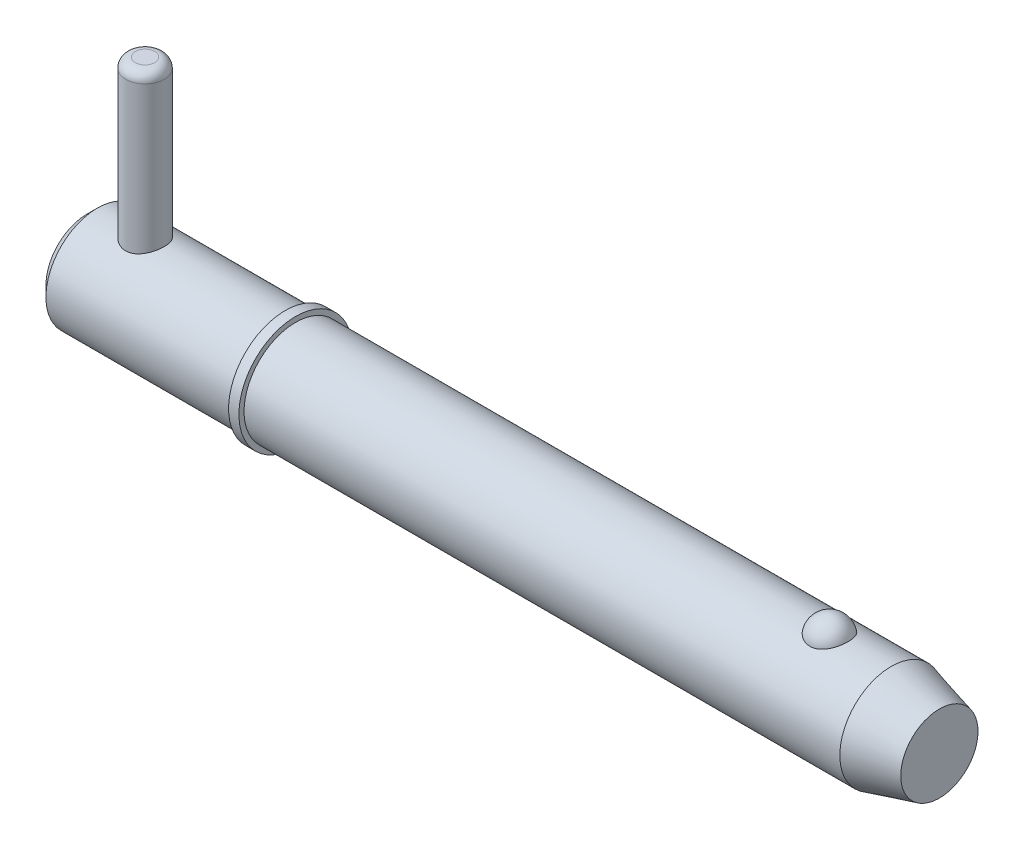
ISO-10303-21;
HEADER;
FILE_DESCRIPTION(('STEP AP214'),'2;1');
FILE_NAME('part.step','',(''),(''),'','','');
FILE_SCHEMA(('AUTOMOTIVE_DESIGN { 1 0 10303 214 1 1 1 1 }'));
ENDSEC;
DATA;
#1=APPLICATION_CONTEXT('core data for automotive mechanical design processes');
#2=APPLICATION_PROTOCOL_DEFINITION('international standard','automotive_design',2000,#1);
#3=PRODUCT_CONTEXT('',#1,'mechanical');
#4=PRODUCT('Part','Part','',(#3));
#5=PRODUCT_RELATED_PRODUCT_CATEGORY('part','',(#4));
#6=PRODUCT_DEFINITION_FORMATION('','',#4);
#7=PRODUCT_DEFINITION_CONTEXT('part definition',#1,'design');
#8=PRODUCT_DEFINITION('design','',#6,#7);
#9=PRODUCT_DEFINITION_SHAPE('','',#8);
#10=(LENGTH_UNIT() NAMED_UNIT(*) SI_UNIT(.MILLI.,.METRE.));
#11=(NAMED_UNIT(*) PLANE_ANGLE_UNIT() SI_UNIT($,.RADIAN.));
#12=(NAMED_UNIT(*) SI_UNIT($,.STERADIAN.) SOLID_ANGLE_UNIT());
#13=UNCERTAINTY_MEASURE_WITH_UNIT(LENGTH_MEASURE(1.E-05),#10,'distance_accuracy_value','');
#14=(GEOMETRIC_REPRESENTATION_CONTEXT(3) GLOBAL_UNCERTAINTY_ASSIGNED_CONTEXT((#13)) GLOBAL_UNIT_ASSIGNED_CONTEXT((#10,
#11,#12)) REPRESENTATION_CONTEXT('',''));
#15=CARTESIAN_POINT('',(0.,0.,0.));
#16=DIRECTION('',(0.,0.,1.));
#17=DIRECTION('',(1.,0.,0.));
#18=AXIS2_PLACEMENT_3D('',#15,#16,#17);
#19=CARTESIAN_POINT('',(7.14,25.4,0.));
#20=DIRECTION('',(0.,-1.,0.));
#21=DIRECTION('',(0.,0.,-1.));
#22=AXIS2_PLACEMENT_3D('',#19,#20,#21);
#23=CYLINDRICAL_SURFACE('',#22,2.38);
#24=CARTESIAN_POINT('',(7.14,-5.16,0.));
#25=DIRECTION('',(0.,1.,0.));
#26=DIRECTION('',(0.,0.,1.));
#27=AXIS2_PLACEMENT_3D('',#24,#25,#26);
#28=CIRCLE('',#27,2.38);
#29=CARTESIAN_POINT('',(7.14,-5.16,2.38));
#30=VERTEX_POINT('',#29);
#31=EDGE_CURVE('P0_E25',#30,#30,#28,.T.);
#32=ORIENTED_EDGE('',*,*,#31,.T.);
#33=EDGE_LOOP('',(#32));
#34=FACE_BOUND('',#33,.T.);
#35=CARTESIAN_POINT('',(7.14,24.21,0.));
#36=DIRECTION('',(0.,1.,0.));
#37=DIRECTION('',(0.,0.,1.));
#38=AXIS2_PLACEMENT_3D('',#35,#36,#37);
#39=CIRCLE('',#38,2.38);
#40=CARTESIAN_POINT('',(7.14,24.21,2.38));
#41=VERTEX_POINT('',#40);
#42=EDGE_CURVE('P0_E29',#41,#41,#39,.F.);
#43=ORIENTED_EDGE('',*,*,#42,.T.);
#44=EDGE_LOOP('',(#43));
#45=FACE_BOUND('',#44,.T.);
#46=ADVANCED_FACE('P0_F14',(#34,#45),#23,.T.);
#47=CARTESIAN_POINT('',(7.14,25.4,0.));
#48=DIRECTION('',(0.,1.,0.));
#49=DIRECTION('',(0.,0.,1.));
#50=AXIS2_PLACEMENT_3D('',#47,#48,#49);
#51=PLANE('',#50);
#52=CARTESIAN_POINT('',(7.14,25.4,0.));
#53=DIRECTION('',(0.,1.,0.));
#54=DIRECTION('',(0.,0.,1.));
#55=AXIS2_PLACEMENT_3D('',#52,#53,#54);
#56=CIRCLE('',#55,1.19);
#57=CARTESIAN_POINT('',(7.14,25.4,1.19));
#58=VERTEX_POINT('',#57);
#59=EDGE_CURVE('P0_E10',#58,#58,#56,.T.);
#60=ORIENTED_EDGE('',*,*,#59,.T.);
#61=EDGE_LOOP('',(#60));
#62=FACE_BOUND('',#61,.T.);
#63=ADVANCED_FACE('P0_F46',(#62),#51,.T.);
#64=CARTESIAN_POINT('',(7.14,-6.35,0.));
#65=DIRECTION('',(0.,1.,0.));
#66=DIRECTION('',(0.,0.,1.));
#67=AXIS2_PLACEMENT_3D('',#64,#65,#66);
#68=PLANE('',#67);
#69=CARTESIAN_POINT('',(7.14,-6.35,0.));
#70=DIRECTION('',(0.,1.,0.));
#71=DIRECTION('',(0.,0.,1.));
#72=AXIS2_PLACEMENT_3D('',#69,#70,#71);
#73=CIRCLE('',#72,1.19);
#74=CARTESIAN_POINT('',(7.14,-6.35,1.19));
#75=VERTEX_POINT('',#74);
#76=EDGE_CURVE('P0_E21',#75,#75,#73,.F.);
#77=ORIENTED_EDGE('',*,*,#76,.T.);
#78=EDGE_LOOP('',(#77));
#79=FACE_BOUND('',#78,.T.);
#80=ADVANCED_FACE('P0_F43',(#79),#68,.F.);
#81=CARTESIAN_POINT('',(7.14,-5.16,0.));
#82=DIRECTION('',(0.,1.,0.));
#83=DIRECTION('',(0.,0.,1.));
#84=AXIS2_PLACEMENT_3D('',#81,#82,#83);
#85=DEGENERATE_TOROIDAL_SURFACE('',#84,1.19,1.19,.T.);
#86=ORIENTED_EDGE('',*,*,#76,.F.);
#87=EDGE_LOOP('',(#86));
#88=FACE_BOUND('',#87,.T.);
#89=ORIENTED_EDGE('',*,*,#31,.F.);
#90=EDGE_LOOP('',(#89));
#91=FACE_BOUND('',#90,.T.);
#92=ADVANCED_FACE('P0_F38',(#88,#91),#85,.T.);
#93=CARTESIAN_POINT('',(7.14,24.21,0.));
#94=DIRECTION('',(0.,1.,0.));
#95=DIRECTION('',(0.,0.,1.));
#96=AXIS2_PLACEMENT_3D('',#93,#94,#95);
#97=DEGENERATE_TOROIDAL_SURFACE('',#96,1.19,1.19,.T.);
#98=ORIENTED_EDGE('',*,*,#42,.F.);
#99=EDGE_LOOP('',(#98));
#100=FACE_BOUND('',#99,.T.);
#101=ORIENTED_EDGE('',*,*,#59,.F.);
#102=EDGE_LOOP('',(#101));
#103=FACE_BOUND('',#102,.T.);
#104=ADVANCED_FACE('P0_F16',(#100,#103),#97,.T.);
#105=CLOSED_SHELL('',(#46,#63,#80,#92,#104));
#106=MANIFOLD_SOLID_BREP('P0_B1',#105);
#107=CARTESIAN_POINT('',(0.,0.,0.));
#108=DIRECTION('',(1.,0.,0.));
#109=DIRECTION('',(0.,0.,-1.));
#110=AXIS2_PLACEMENT_3D('',#107,#108,#109);
#111=CYLINDRICAL_SURFACE('',#110,6.35);
#112=CARTESIAN_POINT('',(99.1553693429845,0.,0.));
#113=DIRECTION('',(1.,0.,0.));
#114=DIRECTION('',(0.,0.,-1.));
#115=AXIS2_PLACEMENT_3D('',#112,#113,#114);
#116=CIRCLE('',#115,6.35);
#117=CARTESIAN_POINT('',(99.1553693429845,0.,-6.35));
#118=VERTEX_POINT('',#117);
#119=EDGE_CURVE('P1_E81',#118,#118,#116,.T.);
#120=ORIENTED_EDGE('',*,*,#119,.F.);
#121=EDGE_LOOP('',(#120));
#122=FACE_BOUND('',#121,.T.);
#123=CARTESIAN_POINT('',(25.7,0.,0.));
#124=DIRECTION('',(1.,0.,0.));
#125=DIRECTION('',(0.,0.,-1.));
#126=AXIS2_PLACEMENT_3D('',#123,#124,#125);
#127=CIRCLE('',#126,6.35);
#128=CARTESIAN_POINT('',(25.7,0.,-6.35));
#129=VERTEX_POINT('',#128);
#130=EDGE_CURVE('P1_E85',#129,#129,#127,.T.);
#131=ORIENTED_EDGE('',*,*,#130,.T.);
#132=EDGE_LOOP('',(#131));
#133=FACE_BOUND('',#132,.T.);
#134=CARTESIAN_POINT('',(91.5300214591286,5.87502187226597,2.40969251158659));
#135=CARTESIAN_POINT('',(91.4050305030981,5.87501645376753,2.40969773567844));
#136=CARTESIAN_POINT('',(91.2800806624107,5.87916061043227,2.39967292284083));
#137=CARTESIAN_POINT('',(91.0339091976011,5.8952311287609,2.3599173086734));
#138=CARTESIAN_POINT('',(90.9126863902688,5.90715499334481,2.33019283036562));
#139=CARTESIAN_POINT('',(90.6775170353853,5.93739567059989,2.25201402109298));
#140=CARTESIAN_POINT('',(90.5635602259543,5.95570321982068,2.2035868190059));
#141=CARTESIAN_POINT('',(90.3455735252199,5.99672067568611,2.08937987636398));
#142=CARTESIAN_POINT('',(90.2415457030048,6.01943149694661,2.02359652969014));
#143=CARTESIAN_POINT('',(90.0429437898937,6.06760647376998,1.87428969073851));
#144=CARTESIAN_POINT('',(89.9487268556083,6.09313095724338,1.79031110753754));
#145=CARTESIAN_POINT('',(89.7752557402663,6.14375873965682,1.60800178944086));
#146=CARTESIAN_POINT('',(89.6960043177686,6.16886196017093,1.50966841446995));
#147=CARTESIAN_POINT('',(89.5508457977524,6.21724600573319,1.29645884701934));
#148=CARTESIAN_POINT('',(89.4856885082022,6.24039621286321,1.18104158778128));
#149=CARTESIAN_POINT('',(89.3747035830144,6.28117277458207,0.940351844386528));
#150=CARTESIAN_POINT('',(89.3288776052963,6.29879865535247,0.815078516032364));
#151=CARTESIAN_POINT('',(89.2570234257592,6.32692073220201,0.556494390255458));
#152=CARTESIAN_POINT('',(89.231249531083,6.33732517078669,0.423102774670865));
#153=CARTESIAN_POINT('',(89.2009885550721,6.34957673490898,0.153542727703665));
#154=CARTESIAN_POINT('',(89.1965009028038,6.35142408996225,0.0173743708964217));
#155=CARTESIAN_POINT('',(89.2088655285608,6.34638925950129,-0.253036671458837));
#156=CARTESIAN_POINT('',(89.2255949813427,6.33955731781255,-0.38728593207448));
#157=CARTESIAN_POINT('',(89.279843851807,6.31794129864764,-0.65085123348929));
#158=CARTESIAN_POINT('',(89.3173636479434,6.30315707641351,-0.78016718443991));
#159=CARTESIAN_POINT('',(89.412500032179,6.26711642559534,-1.03041949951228));
#160=CARTESIAN_POINT('',(89.470143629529,6.24585130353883,-1.15134433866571));
#161=CARTESIAN_POINT('',(89.6043522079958,6.19905619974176,-1.38129800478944));
#162=CARTESIAN_POINT('',(89.680918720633,6.17352587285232,-1.49032586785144));
#163=CARTESIAN_POINT('',(89.8517538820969,6.12080227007,-1.69393164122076));
#164=CARTESIAN_POINT('',(89.9461008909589,6.09360200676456,-1.78844209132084));
#165=CARTESIAN_POINT('',(90.1501196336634,6.04070434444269,-1.95970536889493));
#166=CARTESIAN_POINT('',(90.2597900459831,6.01500681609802,-2.03645972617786));
#167=CARTESIAN_POINT('',(90.4891876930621,5.96867714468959,-2.1684564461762));
#168=CARTESIAN_POINT('',(90.6086522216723,5.94794910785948,-2.2241206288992));
#169=CARTESIAN_POINT('',(90.8562188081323,5.91340580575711,-2.31440992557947));
#170=CARTESIAN_POINT('',(90.9843175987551,5.89958794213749,-2.3490429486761));
#171=CARTESIAN_POINT('',(91.238582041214,5.88111049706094,-2.39491590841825));
#172=CARTESIAN_POINT('',(91.3645207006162,5.876025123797,-2.40724512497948));
#173=CARTESIAN_POINT('',(91.6167867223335,5.87428980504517,-2.41147867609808));
#174=CARTESIAN_POINT('',(91.743114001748,5.87763817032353,-2.40338710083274));
#175=CARTESIAN_POINT('',(91.9884170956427,5.89212921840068,-2.36762715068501));
#176=CARTESIAN_POINT('',(92.1074992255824,5.90302431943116,-2.34058030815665));
#177=CARTESIAN_POINT('',(92.3392447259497,5.93113752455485,-2.26839066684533));
#178=CARTESIAN_POINT('',(92.4519075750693,5.94835614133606,-2.2232464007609));
#179=CARTESIAN_POINT('',(92.6704009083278,5.98773016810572,-2.11493806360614));
#180=CARTESIAN_POINT('',(92.776028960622,6.00998499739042,-2.05140269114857));
#181=CARTESIAN_POINT('',(92.9753006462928,6.05690144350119,-1.90842705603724));
#182=CARTESIAN_POINT('',(93.0689415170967,6.08156361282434,-1.8289831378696));
#183=CARTESIAN_POINT('',(93.2466754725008,6.13211715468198,-1.65182429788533));
#184=CARTESIAN_POINT('',(93.330055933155,6.15800825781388,-1.55339381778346));
#185=CARTESIAN_POINT('',(93.4797900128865,6.20712834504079,-1.34374214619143));
#186=CARTESIAN_POINT('',(93.5461405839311,6.23035685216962,-1.23251867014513));
#187=CARTESIAN_POINT('',(93.6623455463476,6.27251177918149,-0.996447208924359));
#188=CARTESIAN_POINT('',(93.7116072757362,6.29127762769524,-0.871278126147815));
#189=CARTESIAN_POINT('',(93.7896142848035,6.3215862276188,-0.613870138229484));
#190=CARTESIAN_POINT('',(93.818359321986,6.33312889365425,-0.481631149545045));
#191=CARTESIAN_POINT('',(93.8547705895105,6.34782349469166,-0.213672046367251));
#192=CARTESIAN_POINT('',(93.8624134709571,6.35096613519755,-0.0779482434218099));
#193=CARTESIAN_POINT('',(93.8563951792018,6.34851322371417,0.19294395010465));
#194=CARTESIAN_POINT('',(93.8427343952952,6.3429178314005,0.328112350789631));
#195=CARTESIAN_POINT('',(93.7945036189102,6.32360512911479,0.593406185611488));
#196=CARTESIAN_POINT('',(93.7600313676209,6.30992579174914,0.723552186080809));
#197=CARTESIAN_POINT('',(93.6709539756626,6.27586325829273,0.975834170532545));
#198=CARTESIAN_POINT('',(93.6163476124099,6.25547965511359,1.09796966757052));
#199=CARTESIAN_POINT('',(93.4877587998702,6.20998183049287,1.33148921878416));
#200=CARTESIAN_POINT('',(93.4136742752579,6.18484288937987,1.44281227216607));
#201=CARTESIAN_POINT('',(93.2478204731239,6.13258735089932,1.65087683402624));
#202=CARTESIAN_POINT('',(93.1560515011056,6.10547078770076,1.74761859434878));
#203=CARTESIAN_POINT('',(92.9571839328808,6.0523587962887,1.92350926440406));
#204=CARTESIAN_POINT('',(92.850133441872,6.0263601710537,2.00271146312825));
#205=CARTESIAN_POINT('',(92.6231384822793,5.97843747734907,2.14154159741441));
#206=CARTESIAN_POINT('',(92.503191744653,5.95651412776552,2.20116608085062));
#207=CARTESIAN_POINT('',(92.2445236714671,5.91812106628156,2.30250570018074));
#208=CARTESIAN_POINT('',(92.1050698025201,5.90217533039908,2.34256795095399));
#209=CARTESIAN_POINT('',(91.8203974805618,5.88063128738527,2.39615214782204));
#210=CARTESIAN_POINT('',(91.6751817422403,5.8750281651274,2.40968644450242));
#211=CARTESIAN_POINT('',(91.5300214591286,5.87502187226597,2.40969251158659));
#212=B_SPLINE_CURVE_WITH_KNOTS('',3,(#134,#135,#136,#137,#138,#139,#140,#141,#142,#143,#144,
#145,#146,#147,#148,#149,#150,#151,#152,#153,#154,#155,#156,#157,#158,#159,#160,#161,#162,#163,
#164,#165,#166,#167,#168,#169,#170,#171,#172,#173,#174,#175,#176,#177,#178,#179,#180,#181,#182,
#183,#184,#185,#186,#187,#188,#189,#190,#191,#192,#193,#194,#195,#196,#197,#198,#199,#200,#201,
#202,#203,#204,#205,#206,#207,#208,#209,#210,#211),.UNSPECIFIED.,.T.,.F.,(4,2,2,2,2,2,2,2,2,2,2,
2,2,2,2,2,2,2,2,2,2,2,2,2,2,2,2,2,2,2,2,2,2,2,2,2,2,2,4),(0.,0.374440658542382,
0.748761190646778,1.12254078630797,1.49639810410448,1.88098871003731,2.26565013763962,
2.66741104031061,3.06920639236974,3.47601794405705,3.88281858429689,4.28727498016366,
4.69173873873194,5.09674745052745,5.50178895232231,5.90865911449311,6.31549420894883,
6.71369855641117,7.11175305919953,7.48978077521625,7.86773278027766,8.2338388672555,
8.59997464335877,8.97409044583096,9.34829231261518,9.74122667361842,10.1342313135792,
10.5397522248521,10.9452779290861,11.3512521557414,11.7572189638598,12.1612938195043,
12.5653932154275,12.9716540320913,13.3779078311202,13.7829098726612,14.1879832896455,
14.6230486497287,15.0579114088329),.UNSPECIFIED.);
#213=CARTESIAN_POINT('',(91.5300214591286,5.87502187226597,2.40969251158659));
#214=VERTEX_POINT('',#213);
#215=EDGE_CURVE('P1_E35',#214,#214,#212,.T.);
#216=ORIENTED_EDGE('',*,*,#215,.T.);
#217=EDGE_LOOP('',(#216));
#218=FACE_BOUND('',#217,.T.);
#219=ADVANCED_FACE('P1_F13',(#122,#133,#218),#111,.T.);
#220=CARTESIAN_POINT('',(0.,0.,0.));
#221=DIRECTION('',(-1.,0.,0.));
#222=DIRECTION('',(0.,0.,1.));
#223=AXIS2_PLACEMENT_3D('',#220,#221,#222);
#224=PLANE('',#223);
#225=CARTESIAN_POINT('',(0.,0.,0.));
#226=DIRECTION('',(1.,0.,0.));
#227=DIRECTION('',(0.,0.,-1.));
#228=AXIS2_PLACEMENT_3D('',#225,#226,#227);
#229=CIRCLE('',#228,5.08);
#230=CARTESIAN_POINT('',(0.,0.,-5.08));
#231=VERTEX_POINT('',#230);
#232=EDGE_CURVE('P1_E9',#231,#231,#229,.T.);
#233=ORIENTED_EDGE('',*,*,#232,.F.);
#234=EDGE_LOOP('',(#233));
#235=FACE_BOUND('',#234,.T.);
#236=ADVANCED_FACE('P1_F15',(#235),#224,.T.);
#237=CARTESIAN_POINT('',(1.27,0.,0.));
#238=DIRECTION('',(1.,0.,0.));
#239=DIRECTION('',(0.,0.,-1.));
#240=AXIS2_PLACEMENT_3D('',#237,#238,#239);
#241=CONICAL_SURFACE('',#240,6.35,0.78539816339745);
#242=ORIENTED_EDGE('',*,*,#232,.T.);
#243=EDGE_LOOP('',(#242));
#244=FACE_BOUND('',#243,.T.);
#245=CARTESIAN_POINT('',(1.27,0.,0.));
#246=DIRECTION('',(1.,0.,0.));
#247=DIRECTION('',(0.,0.,-1.));
#248=AXIS2_PLACEMENT_3D('',#245,#246,#247);
#249=CIRCLE('',#248,6.35);
#250=CARTESIAN_POINT('',(1.27,0.,-6.35));
#251=VERTEX_POINT('',#250);
#252=EDGE_CURVE('P1_E26',#251,#251,#249,.T.);
#253=ORIENTED_EDGE('',*,*,#252,.F.);
#254=EDGE_LOOP('',(#253));
#255=FACE_BOUND('',#254,.T.);
#256=ADVANCED_FACE('P1_F77',(#244,#255),#241,.T.);
#257=CARTESIAN_POINT('',(0.,0.,0.));
#258=DIRECTION('',(1.,0.,0.));
#259=DIRECTION('',(0.,0.,-1.));
#260=AXIS2_PLACEMENT_3D('',#257,#258,#259);
#261=CYLINDRICAL_SURFACE('',#260,6.35);
#262=CARTESIAN_POINT('',(7.14,-5.88711304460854,2.38));
#263=CARTESIAN_POINT('',(7.01146258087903,-5.88710856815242,2.38000480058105));
#264=CARTESIAN_POINT('',(6.88295682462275,-5.89136840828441,2.36955244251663));
#265=CARTESIAN_POINT('',(6.62981934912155,-5.90782785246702,2.32820953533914));
#266=CARTESIAN_POINT('',(6.50518751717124,-5.92002722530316,2.29731958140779));
#267=CARTESIAN_POINT('',(6.26352403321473,-5.95079384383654,2.21639366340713));
#268=CARTESIAN_POINT('',(6.14647496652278,-5.96934583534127,2.16640353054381));
#269=CARTESIAN_POINT('',(5.92237941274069,-6.01070278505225,2.04885862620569));
#270=CARTESIAN_POINT('',(5.81533593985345,-6.03350901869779,1.98129858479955));
#271=CARTESIAN_POINT('',(5.60897525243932,-6.08207341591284,1.82693902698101));
#272=CARTESIAN_POINT('',(5.51022503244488,-6.10791836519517,1.73940861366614));
#273=CARTESIAN_POINT('',(5.32840561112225,-6.15892405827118,1.54914379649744));
#274=CARTESIAN_POINT('',(5.24533975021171,-6.1840846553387,1.44640616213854));
#275=CARTESIAN_POINT('',(5.09451639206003,-6.23191821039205,1.22434014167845));
#276=CARTESIAN_POINT('',(5.02737511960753,-6.25447755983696,1.10456656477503));
#277=CARTESIAN_POINT('',(4.91443001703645,-6.2935236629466,0.854429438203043));
#278=CARTESIAN_POINT('',(4.86861879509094,-6.31001251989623,0.724069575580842));
#279=CARTESIAN_POINT('',(4.80162253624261,-6.33444370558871,0.46242122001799));
#280=CARTESIAN_POINT('',(4.77946137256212,-6.34272370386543,0.331414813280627));
#281=CARTESIAN_POINT('',(4.75726677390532,-6.35101600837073,0.0672982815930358));
#282=CARTESIAN_POINT('',(4.75722615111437,-6.35103100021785,-0.0658111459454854));
#283=CARTESIAN_POINT('',(4.77870510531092,-6.3430064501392,-0.323358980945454));
#284=CARTESIAN_POINT('',(4.79915922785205,-6.33536494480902,-0.447900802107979));
#285=CARTESIAN_POINT('',(4.85925493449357,-6.31340794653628,-0.69163609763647));
#286=CARTESIAN_POINT('',(4.89889787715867,-6.29909198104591,-0.810829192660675));
#287=CARTESIAN_POINT('',(4.9967414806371,-6.26494471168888,-1.04254212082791));
#288=CARTESIAN_POINT('',(5.05520370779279,-6.24503620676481,-1.1549396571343));
#289=CARTESIAN_POINT('',(5.1887948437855,-6.20171869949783,-1.3686079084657));
#290=CARTESIAN_POINT('',(5.26392912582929,-6.17830856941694,-1.46987502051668));
#291=CARTESIAN_POINT('',(5.43386591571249,-6.12878580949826,-1.66468415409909));
#292=CARTESIAN_POINT('',(5.52956139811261,-6.10259519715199,-1.75742857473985));
#293=CARTESIAN_POINT('',(5.73530435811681,-6.05155777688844,-1.92585331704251));
#294=CARTESIAN_POINT('',(5.84535542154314,-6.02671130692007,-2.00152936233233));
#295=CARTESIAN_POINT('',(6.07982989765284,-5.98068420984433,-2.13519109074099));
#296=CARTESIAN_POINT('',(6.20451768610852,-5.95959698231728,-2.19274775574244));
#297=CARTESIAN_POINT('',(6.4628145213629,-5.92455622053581,-2.28574558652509));
#298=CARTESIAN_POINT('',(6.59641856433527,-5.91059872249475,-2.32119904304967));
#299=CARTESIAN_POINT('',(6.86087441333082,-5.8923327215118,-2.36717069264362));
#300=CARTESIAN_POINT('',(6.99147192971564,-5.8875347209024,-2.37895573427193));
#301=CARTESIAN_POINT('',(7.25283805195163,-5.88674545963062,-2.38091046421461));
#302=CARTESIAN_POINT('',(7.38360660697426,-5.89075200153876,-2.37108554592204));
#303=CARTESIAN_POINT('',(7.63510696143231,-5.90662331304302,-2.33124781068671));
#304=CARTESIAN_POINT('',(7.75602069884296,-5.91810660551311,-2.30221396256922));
#305=CARTESIAN_POINT('',(7.99120505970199,-5.94718527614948,-2.22601401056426));
#306=CARTESIAN_POINT('',(8.10547431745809,-5.96478190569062,-2.17884419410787));
#307=CARTESIAN_POINT('',(8.32888632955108,-6.00491533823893,-2.06572311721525));
#308=CARTESIAN_POINT('',(8.43767672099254,-6.02761250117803,-1.99913452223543));
#309=CARTESIAN_POINT('',(8.6429894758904,-6.07511988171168,-1.84974438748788));
#310=CARTESIAN_POINT('',(8.73950733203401,-6.09993087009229,-1.76693691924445));
#311=CARTESIAN_POINT('',(8.9238741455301,-6.1507686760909,-1.58125563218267));
#312=CARTESIAN_POINT('',(9.01078732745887,-6.17677301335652,-1.47744327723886));
#313=CARTESIAN_POINT('',(9.16607127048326,-6.22556172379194,-1.25606967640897));
#314=CARTESIAN_POINT('',(9.23444197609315,-6.24834608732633,-1.13850838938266));
#315=CARTESIAN_POINT('',(9.3502493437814,-6.28811144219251,-0.893050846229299));
#316=CARTESIAN_POINT('',(9.39775808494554,-6.30511236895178,-0.765192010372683));
#317=CARTESIAN_POINT('',(9.47032640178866,-6.33145833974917,-0.502514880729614));
#318=CARTESIAN_POINT('',(9.49539651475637,-6.34080697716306,-0.367699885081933));
#319=CARTESIAN_POINT('',(9.52124059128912,-6.35045496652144,-0.103396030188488));
#320=CARTESIAN_POINT('',(9.52334421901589,-6.35124952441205,0.025945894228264));
#321=CARTESIAN_POINT('',(9.50661518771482,-6.34499064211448,0.283061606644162));
#322=CARTESIAN_POINT('',(9.48778504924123,-6.33793814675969,0.410835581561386));
#323=CARTESIAN_POINT('',(9.43065630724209,-6.31700307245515,0.658028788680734));
#324=CARTESIAN_POINT('',(9.39284291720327,-6.30329098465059,0.7775756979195));
#325=CARTESIAN_POINT('',(9.29930406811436,-6.27046903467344,1.00863789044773));
#326=CARTESIAN_POINT('',(9.2435752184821,-6.25135815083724,1.12015164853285));
#327=CARTESIAN_POINT('',(9.11312349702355,-6.20865254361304,1.33711407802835));
#328=CARTESIAN_POINT('',(9.03770094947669,-6.18490316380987,1.44211105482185));
#329=CARTESIAN_POINT('',(8.87110640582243,-6.13583718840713,1.63836897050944));
#330=CARTESIAN_POINT('',(8.77992879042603,-6.11052003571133,1.72962498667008));
#331=CARTESIAN_POINT('',(8.57869799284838,-6.05953829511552,1.90076098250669));
#332=CARTESIAN_POINT('',(8.46790320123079,-6.03392573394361,1.97978778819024));
#333=CARTESIAN_POINT('',(8.23379693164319,-5.98676607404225,2.11813466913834));
#334=CARTESIAN_POINT('',(8.11048418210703,-5.9652193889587,2.17745273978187));
#335=CARTESIAN_POINT('',(7.84900037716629,-5.92818393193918,2.27641807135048));
#336=CARTESIAN_POINT('',(7.71041678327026,-5.91299857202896,2.31510015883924));
#337=CARTESIAN_POINT('',(7.42787316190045,-5.89246887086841,2.36688002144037));
#338=CARTESIAN_POINT('',(7.28391673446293,-5.88711805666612,2.37999462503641));
#339=CARTESIAN_POINT('',(7.14,-5.88711304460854,2.38));
#340=B_SPLINE_CURVE_WITH_KNOTS('',3,(#262,#263,#264,#265,#266,#267,#268,#269,#270,#271,#272,
#273,#274,#275,#276,#277,#278,#279,#280,#281,#282,#283,#284,#285,#286,#287,#288,#289,#290,#291,
#292,#293,#294,#295,#296,#297,#298,#299,#300,#301,#302,#303,#304,#305,#306,#307,#308,#309,#310,
#311,#312,#313,#314,#315,#316,#317,#318,#319,#320,#321,#322,#323,#324,#325,#326,#327,#328,#329,
#330,#331,#332,#333,#334,#335,#336,#337,#338,#339),.UNSPECIFIED.,.T.,.F.,(4,2,2,2,2,2,2,2,2,2,2,
2,2,2,2,2,2,2,2,2,2,2,2,2,2,2,2,2,2,2,2,2,2,2,2,2,2,2,4),(0.,0.385076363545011,
0.770141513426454,1.15428843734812,1.53855071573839,1.94016118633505,2.3418570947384,
2.75720522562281,3.1724093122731,3.569721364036,3.96690431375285,4.34445758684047,
4.72203759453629,5.10511017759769,5.48830640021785,5.89390240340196,6.29959991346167,
6.71428455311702,7.12873839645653,7.52034494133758,7.91185376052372,8.28480528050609,
8.65783318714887,9.0448340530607,9.43197664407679,9.84363087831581,10.2552863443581,
10.6655081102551,11.0755371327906,11.4616919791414,11.847800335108,12.224507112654,
12.6012852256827,12.9938941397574,13.386643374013,13.8000944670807,14.2135876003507,
14.6450218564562,15.0761720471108),.UNSPECIFIED.);
#341=CARTESIAN_POINT('',(7.14,-5.88711304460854,2.38));
#342=VERTEX_POINT('',#341);
#343=EDGE_CURVE('P1_E17',#342,#342,#340,.T.);
#344=ORIENTED_EDGE('',*,*,#343,.F.);
#345=EDGE_LOOP('',(#344));
#346=FACE_BOUND('',#345,.T.);
#347=CARTESIAN_POINT('',(7.14,5.88711304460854,2.38));
#348=CARTESIAN_POINT('',(7.26853741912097,5.88710856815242,2.38000480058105));
#349=CARTESIAN_POINT('',(7.39704317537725,5.89136840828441,2.36955244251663));
#350=CARTESIAN_POINT('',(7.65018065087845,5.90782785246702,2.32820953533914));
#351=CARTESIAN_POINT('',(7.77481248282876,5.92002722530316,2.29731958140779));
#352=CARTESIAN_POINT('',(8.01647596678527,5.95079384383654,2.21639366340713));
#353=CARTESIAN_POINT('',(8.13352503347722,5.96934583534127,2.16640353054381));
#354=CARTESIAN_POINT('',(8.35762058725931,6.01070278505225,2.04885862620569));
#355=CARTESIAN_POINT('',(8.46466406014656,6.03350901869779,1.98129858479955));
#356=CARTESIAN_POINT('',(8.67102474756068,6.08207341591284,1.82693902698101));
#357=CARTESIAN_POINT('',(8.76977496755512,6.10791836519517,1.73940861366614));
#358=CARTESIAN_POINT('',(8.95159438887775,6.15892405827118,1.54914379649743));
#359=CARTESIAN_POINT('',(9.03466024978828,6.1840846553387,1.44640616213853));
#360=CARTESIAN_POINT('',(9.18548360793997,6.23191821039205,1.22434014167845));
#361=CARTESIAN_POINT('',(9.25262488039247,6.25447755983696,1.10456656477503));
#362=CARTESIAN_POINT('',(9.36556998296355,6.2935236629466,0.854429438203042));
#363=CARTESIAN_POINT('',(9.41138120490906,6.31001251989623,0.72406957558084));
#364=CARTESIAN_POINT('',(9.47837746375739,6.33444370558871,0.462421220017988));
#365=CARTESIAN_POINT('',(9.50053862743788,6.34272370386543,0.331414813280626));
#366=CARTESIAN_POINT('',(9.52273322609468,6.35101600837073,0.0672982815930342));
#367=CARTESIAN_POINT('',(9.52277384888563,6.35103100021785,-0.0658111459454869));
#368=CARTESIAN_POINT('',(9.50129489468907,6.3430064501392,-0.323358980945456));
#369=CARTESIAN_POINT('',(9.48084077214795,6.33536494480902,-0.447900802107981));
#370=CARTESIAN_POINT('',(9.42074506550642,6.31340794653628,-0.691636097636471));
#371=CARTESIAN_POINT('',(9.38110212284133,6.29909198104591,-0.810829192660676));
#372=CARTESIAN_POINT('',(9.2832585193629,6.26494471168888,-1.04254212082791));
#373=CARTESIAN_POINT('',(9.22479629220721,6.24503620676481,-1.1549396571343));
#374=CARTESIAN_POINT('',(9.0912051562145,6.20171869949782,-1.3686079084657));
#375=CARTESIAN_POINT('',(9.0160708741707,6.17830856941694,-1.46987502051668));
#376=CARTESIAN_POINT('',(8.84613408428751,6.12878580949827,-1.66468415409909));
#377=CARTESIAN_POINT('',(8.75043860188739,6.10259519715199,-1.75742857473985));
#378=CARTESIAN_POINT('',(8.54469564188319,6.05155777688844,-1.92585331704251));
#379=CARTESIAN_POINT('',(8.43464457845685,6.02671130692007,-2.00152936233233));
#380=CARTESIAN_POINT('',(8.20017010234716,5.98068420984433,-2.13519109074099));
#381=CARTESIAN_POINT('',(8.07548231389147,5.95959698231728,-2.19274775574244));
#382=CARTESIAN_POINT('',(7.8171854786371,5.9245562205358,-2.28574558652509));
#383=CARTESIAN_POINT('',(7.68358143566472,5.91059872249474,-2.32119904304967));
#384=CARTESIAN_POINT('',(7.41912558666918,5.8923327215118,-2.36717069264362));
#385=CARTESIAN_POINT('',(7.28852807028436,5.8875347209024,-2.37895573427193));
#386=CARTESIAN_POINT('',(7.02716194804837,5.88674545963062,-2.38091046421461));
#387=CARTESIAN_POINT('',(6.89639339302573,5.89075200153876,-2.37108554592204));
#388=CARTESIAN_POINT('',(6.64489303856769,5.90662331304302,-2.33124781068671));
#389=CARTESIAN_POINT('',(6.52397930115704,5.91810660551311,-2.30221396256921));
#390=CARTESIAN_POINT('',(6.288794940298,5.94718527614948,-2.22601401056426));
#391=CARTESIAN_POINT('',(6.17452568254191,5.96478190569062,-2.17884419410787));
#392=CARTESIAN_POINT('',(5.95111367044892,6.00491533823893,-2.06572311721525));
#393=CARTESIAN_POINT('',(5.84232327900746,6.02761250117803,-1.99913452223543));
#394=CARTESIAN_POINT('',(5.6370105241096,6.07511988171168,-1.84974438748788));
#395=CARTESIAN_POINT('',(5.54049266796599,6.09993087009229,-1.76693691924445));
#396=CARTESIAN_POINT('',(5.3561258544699,6.1507686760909,-1.58125563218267));
#397=CARTESIAN_POINT('',(5.26921267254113,6.17677301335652,-1.47744327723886));
#398=CARTESIAN_POINT('',(5.11392872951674,6.22556172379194,-1.25606967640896));
#399=CARTESIAN_POINT('',(5.04555802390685,6.24834608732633,-1.13850838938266));
#400=CARTESIAN_POINT('',(4.9297506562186,6.28811144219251,-0.893050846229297));
#401=CARTESIAN_POINT('',(4.88224191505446,6.30511236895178,-0.76519201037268));
#402=CARTESIAN_POINT('',(4.80967359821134,6.33145833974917,-0.502514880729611));
#403=CARTESIAN_POINT('',(4.78460348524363,6.34080697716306,-0.36769988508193));
#404=CARTESIAN_POINT('',(4.75875940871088,6.35045496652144,-0.103396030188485));
#405=CARTESIAN_POINT('',(4.75665578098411,6.35124952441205,0.025945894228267));
#406=CARTESIAN_POINT('',(4.77338481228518,6.34499064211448,0.283061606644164));
#407=CARTESIAN_POINT('',(4.79221495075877,6.33793814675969,0.410835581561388));
#408=CARTESIAN_POINT('',(4.84934369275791,6.31700307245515,0.658028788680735));
#409=CARTESIAN_POINT('',(4.88715708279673,6.30329098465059,0.777575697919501));
#410=CARTESIAN_POINT('',(4.98069593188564,6.27046903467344,1.00863789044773));
#411=CARTESIAN_POINT('',(5.0364247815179,6.25135815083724,1.12015164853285));
#412=CARTESIAN_POINT('',(5.16687650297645,6.20865254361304,1.33711407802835));
#413=CARTESIAN_POINT('',(5.24229905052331,6.18490316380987,1.44211105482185));
#414=CARTESIAN_POINT('',(5.40889359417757,6.13583718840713,1.63836897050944));
#415=CARTESIAN_POINT('',(5.50007120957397,6.11052003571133,1.72962498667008));
#416=CARTESIAN_POINT('',(5.70130200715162,6.05953829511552,1.90076098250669));
#417=CARTESIAN_POINT('',(5.81209679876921,6.03392573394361,1.97978778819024));
#418=CARTESIAN_POINT('',(6.04620306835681,5.98676607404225,2.11813466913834));
#419=CARTESIAN_POINT('',(6.16951581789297,5.9652193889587,2.17745273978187));
#420=CARTESIAN_POINT('',(6.43099962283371,5.92818393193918,2.27641807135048));
#421=CARTESIAN_POINT('',(6.56958321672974,5.91299857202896,2.31510015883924));
#422=CARTESIAN_POINT('',(6.85212683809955,5.89246887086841,2.36688002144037));
#423=CARTESIAN_POINT('',(6.99608326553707,5.88711805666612,2.37999462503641));
#424=CARTESIAN_POINT('',(7.14,5.88711304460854,2.38));
#425=B_SPLINE_CURVE_WITH_KNOTS('',3,(#347,#348,#349,#350,#351,#352,#353,#354,#355,#356,#357,
#358,#359,#360,#361,#362,#363,#364,#365,#366,#367,#368,#369,#370,#371,#372,#373,#374,#375,#376,
#377,#378,#379,#380,#381,#382,#383,#384,#385,#386,#387,#388,#389,#390,#391,#392,#393,#394,#395,
#396,#397,#398,#399,#400,#401,#402,#403,#404,#405,#406,#407,#408,#409,#410,#411,#412,#413,#414,
#415,#416,#417,#418,#419,#420,#421,#422,#423,#424),.UNSPECIFIED.,.T.,.F.,(4,2,2,2,2,2,2,2,2,2,2,
2,2,2,2,2,2,2,2,2,2,2,2,2,2,2,2,2,2,2,2,2,2,2,2,2,2,2,4),(0.,0.385076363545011,
0.770141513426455,1.15428843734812,1.53855071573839,1.94016118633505,2.3418570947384,
2.75720522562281,3.1724093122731,3.56972136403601,3.96690431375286,4.34445758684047,
4.72203759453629,5.10511017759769,5.48830640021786,5.89390240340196,6.29959991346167,
6.71428455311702,7.12873839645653,7.52034494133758,7.91185376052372,8.2848052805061,
8.65783318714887,9.0448340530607,9.43197664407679,9.84363087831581,10.2552863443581,
10.6655081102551,11.0755371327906,11.4616919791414,11.847800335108,12.2245071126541,
12.6012852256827,12.9938941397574,13.386643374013,13.8000944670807,14.2135876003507,
14.6450218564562,15.0761720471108),.UNSPECIFIED.);
#426=CARTESIAN_POINT('',(7.14,5.88711304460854,2.38));
#427=VERTEX_POINT('',#426);
#428=EDGE_CURVE('P1_E43',#427,#427,#425,.T.);
#429=ORIENTED_EDGE('',*,*,#428,.F.);
#430=EDGE_LOOP('',(#429));
#431=FACE_BOUND('',#430,.T.);
#432=ORIENTED_EDGE('',*,*,#252,.T.);
#433=EDGE_LOOP('',(#432));
#434=FACE_BOUND('',#433,.T.);
#435=CARTESIAN_POINT('',(24.43,0.,0.));
#436=DIRECTION('',(1.,0.,0.));
#437=DIRECTION('',(0.,0.,-1.));
#438=AXIS2_PLACEMENT_3D('',#435,#436,#437);
#439=CIRCLE('',#438,6.35);
#440=CARTESIAN_POINT('',(24.43,0.,-6.35));
#441=VERTEX_POINT('',#440);
#442=EDGE_CURVE('P1_E31',#441,#441,#439,.T.);
#443=ORIENTED_EDGE('',*,*,#442,.F.);
#444=EDGE_LOOP('',(#443));
#445=FACE_BOUND('',#444,.T.);
#446=ADVANCED_FACE('P1_F103',(#346,#431,#434,#445),#261,.T.);
#447=CARTESIAN_POINT('',(24.43,6.35,0.));
#448=DIRECTION('',(-1.,0.,0.));
#449=DIRECTION('',(0.,0.,1.));
#450=AXIS2_PLACEMENT_3D('',#447,#448,#449);
#451=PLANE('',#450);
#452=ORIENTED_EDGE('',*,*,#442,.T.);
#453=EDGE_LOOP('',(#452));
#454=FACE_BOUND('',#453,.T.);
#455=CARTESIAN_POINT('',(24.43,0.,0.));
#456=DIRECTION('',(1.,0.,0.));
#457=DIRECTION('',(0.,0.,-1.));
#458=AXIS2_PLACEMENT_3D('',#455,#456,#457);
#459=CIRCLE('',#458,6.985);
#460=CARTESIAN_POINT('',(24.43,0.,-6.985));
#461=VERTEX_POINT('',#460);
#462=EDGE_CURVE('P1_E91',#461,#461,#459,.T.);
#463=ORIENTED_EDGE('',*,*,#462,.F.);
#464=EDGE_LOOP('',(#463));
#465=FACE_BOUND('',#464,.T.);
#466=ADVANCED_FACE('P1_F100',(#454,#465),#451,.T.);
#467=CARTESIAN_POINT('',(0.,0.,0.));
#468=DIRECTION('',(1.,0.,0.));
#469=DIRECTION('',(0.,0.,-1.));
#470=AXIS2_PLACEMENT_3D('',#467,#468,#469);
#471=CYLINDRICAL_SURFACE('',#470,6.985);
#472=ORIENTED_EDGE('',*,*,#462,.T.);
#473=EDGE_LOOP('',(#472));
#474=FACE_BOUND('',#473,.T.);
#475=CARTESIAN_POINT('',(25.7,0.,0.));
#476=DIRECTION('',(1.,0.,0.));
#477=DIRECTION('',(0.,0.,-1.));
#478=AXIS2_PLACEMENT_3D('',#475,#476,#477);
#479=CIRCLE('',#478,6.985);
#480=CARTESIAN_POINT('',(25.7,0.,-6.985));
#481=VERTEX_POINT('',#480);
#482=EDGE_CURVE('P1_E88',#481,#481,#479,.T.);
#483=ORIENTED_EDGE('',*,*,#482,.F.);
#484=EDGE_LOOP('',(#483));
#485=FACE_BOUND('',#484,.T.);
#486=ADVANCED_FACE('P1_F68',(#474,#485),#471,.T.);
#487=CARTESIAN_POINT('',(25.7,6.985,0.));
#488=DIRECTION('',(1.,0.,0.));
#489=DIRECTION('',(0.,0.,-1.));
#490=AXIS2_PLACEMENT_3D('',#487,#488,#489);
#491=PLANE('',#490);
#492=ORIENTED_EDGE('',*,*,#482,.T.);
#493=EDGE_LOOP('',(#492));
#494=FACE_BOUND('',#493,.T.);
#495=ORIENTED_EDGE('',*,*,#130,.F.);
#496=EDGE_LOOP('',(#495));
#497=FACE_BOUND('',#496,.T.);
#498=ADVANCED_FACE('P1_F62',(#494,#497),#491,.T.);
#499=CARTESIAN_POINT('',(105.08,0.,0.));
#500=DIRECTION('',(-1.,0.,0.));
#501=DIRECTION('',(0.,0.,1.));
#502=AXIS2_PLACEMENT_3D('',#499,#500,#501);
#503=CONICAL_SURFACE('',#502,4.76250000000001,0.26179938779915);
#504=ORIENTED_EDGE('',*,*,#119,.T.);
#505=EDGE_LOOP('',(#504));
#506=FACE_BOUND('',#505,.T.);
#507=CARTESIAN_POINT('',(105.08,0.,0.));
#508=DIRECTION('',(1.,0.,0.));
#509=DIRECTION('',(0.,0.,-1.));
#510=AXIS2_PLACEMENT_3D('',#507,#508,#509);
#511=CIRCLE('',#510,4.76250000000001);
#512=CARTESIAN_POINT('',(105.08,0.,-4.76250000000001));
#513=VERTEX_POINT('',#512);
#514=EDGE_CURVE('P1_E42',#513,#513,#511,.T.);
#515=ORIENTED_EDGE('',*,*,#514,.F.);
#516=EDGE_LOOP('',(#515));
#517=FACE_BOUND('',#516,.T.);
#518=ADVANCED_FACE('P1_F59',(#506,#517),#503,.T.);
#519=CARTESIAN_POINT('',(105.08,4.76250000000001,0.));
#520=DIRECTION('',(1.,0.,0.));
#521=DIRECTION('',(0.,0.,-1.));
#522=AXIS2_PLACEMENT_3D('',#519,#520,#521);
#523=PLANE('',#522);
#524=ORIENTED_EDGE('',*,*,#514,.T.);
#525=EDGE_LOOP('',(#524));
#526=FACE_BOUND('',#525,.T.);
#527=ADVANCED_FACE('P1_F55',(#526),#523,.T.);
#528=CARTESIAN_POINT('',(91.5300214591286,5.715,0.));
#529=DIRECTION('',(-1.,0.,0.));
#530=DIRECTION('',(0.,1.,0.));
#531=AXIS2_PLACEMENT_3D('',#528,#529,#530);
#532=SPHERICAL_SURFACE('',#531,2.415);
#533=ORIENTED_EDGE('',*,*,#215,.F.);
#534=EDGE_LOOP('',(#533));
#535=FACE_BOUND('',#534,.T.);
#536=ADVANCED_FACE('P1_F50',(#535),#532,.T.);
#537=CARTESIAN_POINT('',(7.14,-6.985,0.));
#538=DIRECTION('',(0.,1.,0.));
#539=DIRECTION('',(0.,0.,1.));
#540=AXIS2_PLACEMENT_3D('',#537,#538,#539);
#541=CYLINDRICAL_SURFACE('',#540,2.38);
#542=ORIENTED_EDGE('',*,*,#343,.T.);
#543=EDGE_LOOP('',(#542));
#544=FACE_BOUND('',#543,.T.);
#545=ORIENTED_EDGE('',*,*,#428,.T.);
#546=EDGE_LOOP('',(#545));
#547=FACE_BOUND('',#546,.T.);
#548=ADVANCED_FACE('P1_F54',(#544,#547),#541,.F.);
#549=CLOSED_SHELL('',(#219,#236,#256,#446,#466,#486,#498,#518,#527,#536,#548));
#550=MANIFOLD_SOLID_BREP('P1_B1',#549);
#551=ADVANCED_BREP_SHAPE_REPRESENTATION('',(#18,#106,#550),#14);
#552=SHAPE_DEFINITION_REPRESENTATION(#9,#551);
ENDSEC;
END-ISO-10303-21;
